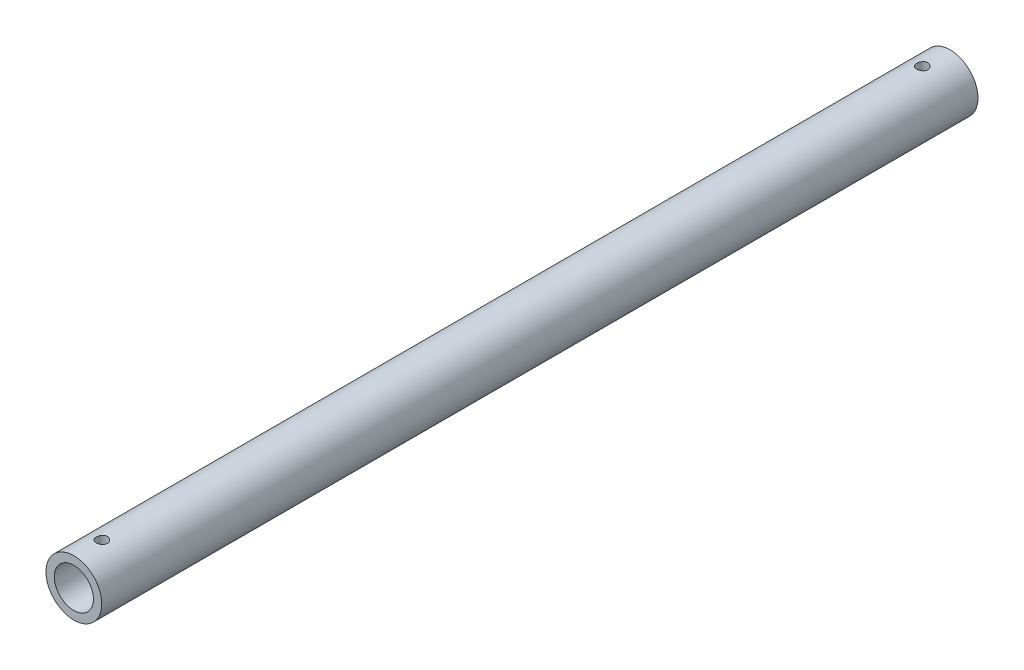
ISO-10303-21;
HEADER;
FILE_DESCRIPTION(('STEP AP214'),'2;1');
FILE_NAME('part.step','',(''),(''),'','','');
FILE_SCHEMA(('AUTOMOTIVE_DESIGN { 1 0 10303 214 1 1 1 1 }'));
ENDSEC;
DATA;
#1=APPLICATION_CONTEXT('core data for automotive mechanical design processes');
#2=APPLICATION_PROTOCOL_DEFINITION('international standard','automotive_design',2000,#1);
#3=PRODUCT_CONTEXT('',#1,'mechanical');
#4=PRODUCT('Part','Part','',(#3));
#5=PRODUCT_RELATED_PRODUCT_CATEGORY('part','',(#4));
#6=PRODUCT_DEFINITION_FORMATION('','',#4);
#7=PRODUCT_DEFINITION_CONTEXT('part definition',#1,'design');
#8=PRODUCT_DEFINITION('design','',#6,#7);
#9=PRODUCT_DEFINITION_SHAPE('','',#8);
#10=(LENGTH_UNIT() NAMED_UNIT(*) SI_UNIT(.MILLI.,.METRE.));
#11=(NAMED_UNIT(*) PLANE_ANGLE_UNIT() SI_UNIT($,.RADIAN.));
#12=(NAMED_UNIT(*) SI_UNIT($,.STERADIAN.) SOLID_ANGLE_UNIT());
#13=UNCERTAINTY_MEASURE_WITH_UNIT(LENGTH_MEASURE(1.E-05),#10,'distance_accuracy_value','');
#14=(GEOMETRIC_REPRESENTATION_CONTEXT(3) GLOBAL_UNCERTAINTY_ASSIGNED_CONTEXT((#13)) GLOBAL_UNIT_ASSIGNED_CONTEXT((#10,
#11,#12)) REPRESENTATION_CONTEXT('',''));
#15=CARTESIAN_POINT('',(0.,0.,0.));
#16=DIRECTION('',(0.,0.,1.));
#17=DIRECTION('',(1.,0.,0.));
#18=AXIS2_PLACEMENT_3D('',#15,#16,#17);
#19=CARTESIAN_POINT('',(0.,0.,157.));
#20=DIRECTION('',(0.,0.,-1.));
#21=DIRECTION('',(-1.,0.,0.));
#22=AXIS2_PLACEMENT_3D('',#19,#20,#21);
#23=CYLINDRICAL_SURFACE('',#22,5.);
#24=CARTESIAN_POINT('',(0.,0.,157.));
#25=DIRECTION('',(0.,0.,1.));
#26=DIRECTION('',(1.,0.,0.));
#27=AXIS2_PLACEMENT_3D('',#24,#25,#26);
#28=CIRCLE('',#27,5.);
#29=CARTESIAN_POINT('',(5.,0.,157.));
#30=VERTEX_POINT('',#29);
#31=EDGE_CURVE('E10',#30,#30,#28,.T.);
#32=ORIENTED_EDGE('',*,*,#31,.F.);
#33=EDGE_LOOP('',(#32));
#34=FACE_BOUND('',#33,.T.);
#35=CARTESIAN_POINT('',(0.,0.,0.));
#36=DIRECTION('',(0.,0.,1.));
#37=DIRECTION('',(1.,0.,0.));
#38=AXIS2_PLACEMENT_3D('',#35,#36,#37);
#39=CIRCLE('',#38,5.);
#40=CARTESIAN_POINT('',(5.,0.,0.));
#41=VERTEX_POINT('',#40);
#42=EDGE_CURVE('E49',#41,#41,#39,.T.);
#43=ORIENTED_EDGE('',*,*,#42,.T.);
#44=EDGE_LOOP('',(#43));
#45=FACE_BOUND('',#44,.T.);
#46=CARTESIAN_POINT('',(0.,-5.,151.));
#47=CARTESIAN_POINT('',(0.0555769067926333,-4.99999897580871,151.000002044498));
#48=CARTESIAN_POINT('',(0.111179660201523,-4.99906385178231,151.004648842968));
#49=CARTESIAN_POINT('',(0.220813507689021,-4.99542365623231,151.023098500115));
#50=CARTESIAN_POINT('',(0.274843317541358,-4.99271717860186,151.036908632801));
#51=CARTESIAN_POINT('',(0.379730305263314,-4.98583649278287,151.073241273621));
#52=CARTESIAN_POINT('',(0.430590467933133,-4.98166369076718,151.095755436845));
#53=CARTESIAN_POINT('',(0.527807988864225,-4.97230398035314,151.148832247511));
#54=CARTESIAN_POINT('',(0.574165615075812,-4.96711713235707,151.179394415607));
#55=CARTESIAN_POINT('',(0.661693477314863,-4.9562216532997,151.248138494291));
#56=CARTESIAN_POINT('',(0.70279395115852,-4.95050745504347,151.286408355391));
#57=CARTESIAN_POINT('',(0.778036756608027,-4.93924180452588,151.369292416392));
#58=CARTESIAN_POINT('',(0.812178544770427,-4.93369036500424,151.413907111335));
#59=CARTESIAN_POINT('',(0.872831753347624,-4.92332441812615,151.508716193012));
#60=CARTESIAN_POINT('',(0.89927093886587,-4.91851707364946,151.558957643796));
#61=CARTESIAN_POINT('',(0.943305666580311,-4.91026268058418,151.663281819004));
#62=CARTESIAN_POINT('',(0.960902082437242,-4.90681549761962,151.717364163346));
#63=CARTESIAN_POINT('',(0.986525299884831,-4.90172805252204,151.827084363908));
#64=CARTESIAN_POINT('',(0.994674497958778,-4.90006470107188,151.882692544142));
#65=CARTESIAN_POINT('',(1.00155212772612,-4.89866375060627,151.994509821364));
#66=CARTESIAN_POINT('',(1.0002815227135,-4.89892595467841,152.05071885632));
#67=CARTESIAN_POINT('',(0.988454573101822,-4.90132551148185,152.161246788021));
#68=CARTESIAN_POINT('',(0.978038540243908,-4.90343452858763,152.215581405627));
#69=CARTESIAN_POINT('',(0.948437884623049,-4.90924546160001,152.321716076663));
#70=CARTESIAN_POINT('',(0.929252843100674,-4.91294745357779,152.373516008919));
#71=CARTESIAN_POINT('',(0.882524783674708,-4.92155618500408,152.473515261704));
#72=CARTESIAN_POINT('',(0.854926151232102,-4.92647089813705,152.521687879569));
#73=CARTESIAN_POINT('',(0.792193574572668,-4.93694618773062,152.612770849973));
#74=CARTESIAN_POINT('',(0.757058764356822,-4.94250683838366,152.655680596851));
#75=CARTESIAN_POINT('',(0.679499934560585,-4.95377021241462,152.735829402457));
#76=CARTESIAN_POINT('',(0.636956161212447,-4.95947369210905,152.772952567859));
#77=CARTESIAN_POINT('',(0.546185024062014,-4.97028848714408,152.839553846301));
#78=CARTESIAN_POINT('',(0.497957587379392,-4.97539979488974,152.869031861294));
#79=CARTESIAN_POINT('',(0.397059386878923,-4.98446690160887,152.919527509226));
#80=CARTESIAN_POINT('',(0.344381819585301,-4.98842088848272,152.940531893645));
#81=CARTESIAN_POINT('',(0.236148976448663,-4.99471408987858,152.973360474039));
#82=CARTESIAN_POINT('',(0.180594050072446,-4.99705350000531,152.985185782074));
#83=CARTESIAN_POINT('',(0.0691794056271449,-4.99982671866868,152.999156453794));
#84=CARTESIAN_POINT('',(0.0133403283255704,-5.0002917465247,153.00146041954));
#85=CARTESIAN_POINT('',(-0.0979249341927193,-4.99935051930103,152.996750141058));
#86=CARTESIAN_POINT('',(-0.153351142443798,-4.99794436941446,152.989736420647));
#87=CARTESIAN_POINT('',(-0.261705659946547,-4.99343832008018,152.966721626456));
#88=CARTESIAN_POINT('',(-0.314651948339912,-4.99035376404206,152.950801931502));
#89=CARTESIAN_POINT('',(-0.417123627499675,-4.98283552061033,152.910516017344));
#90=CARTESIAN_POINT('',(-0.466648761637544,-4.97840173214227,152.886149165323));
#91=CARTESIAN_POINT('',(-0.561541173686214,-4.96859911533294,152.829317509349));
#92=CARTESIAN_POINT('',(-0.60685012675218,-4.96321950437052,152.796757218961));
#93=CARTESIAN_POINT('',(-0.691418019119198,-4.95214734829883,152.724590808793));
#94=CARTESIAN_POINT('',(-0.730676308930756,-4.94645476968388,152.6849839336));
#95=CARTESIAN_POINT('',(-0.802640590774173,-4.93529303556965,152.599126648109));
#96=CARTESIAN_POINT('',(-0.835237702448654,-4.92982860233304,152.552784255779));
#97=CARTESIAN_POINT('',(-0.892185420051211,-4.91984191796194,152.455188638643));
#98=CARTESIAN_POINT('',(-0.916536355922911,-4.91531962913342,152.403935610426));
#99=CARTESIAN_POINT('',(-0.956151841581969,-4.90776740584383,152.29823175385));
#100=CARTESIAN_POINT('',(-0.971463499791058,-4.90472974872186,152.24379915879));
#101=CARTESIAN_POINT('',(-0.9927086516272,-4.90047436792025,152.133066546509));
#102=CARTESIAN_POINT('',(-0.998643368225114,-4.89925640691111,152.076766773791));
#103=CARTESIAN_POINT('',(-1.00092091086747,-4.89879149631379,151.964991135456));
#104=CARTESIAN_POINT('',(-0.997435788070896,-4.89950919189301,151.909518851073));
#105=CARTESIAN_POINT('',(-0.981352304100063,-4.90275573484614,151.799968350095));
#106=CARTESIAN_POINT('',(-0.968754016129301,-4.90528456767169,151.745890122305));
#107=CARTESIAN_POINT('',(-0.93487856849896,-4.91185264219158,151.640772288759));
#108=CARTESIAN_POINT('',(-0.913622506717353,-4.9158882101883,151.589725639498));
#109=CARTESIAN_POINT('',(-0.863054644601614,-4.9250171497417,151.491896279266));
#110=CARTESIAN_POINT('',(-0.83374216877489,-4.93011060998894,151.445113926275));
#111=CARTESIAN_POINT('',(-0.767305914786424,-4.94088960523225,151.35628442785));
#112=CARTESIAN_POINT('',(-0.730057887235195,-4.94658372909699,151.314331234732));
#113=CARTESIAN_POINT('',(-0.649064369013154,-4.95786081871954,151.237213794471));
#114=CARTESIAN_POINT('',(-0.605317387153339,-4.96344375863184,151.202051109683));
#115=CARTESIAN_POINT('',(-0.512017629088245,-4.97393832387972,151.139165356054));
#116=CARTESIAN_POINT('',(-0.462408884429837,-4.97884231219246,151.11152399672));
#117=CARTESIAN_POINT('',(-0.359166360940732,-4.98735125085,151.065013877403));
#118=CARTESIAN_POINT('',(-0.30553626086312,-4.99095737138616,151.046137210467));
#119=CARTESIAN_POINT('',(-0.209821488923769,-4.99576372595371,151.021348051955));
#120=CARTESIAN_POINT('',(-0.168281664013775,-4.99734303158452,151.013356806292));
#121=CARTESIAN_POINT('',(-0.0844995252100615,-4.99946154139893,151.002682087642));
#122=CARTESIAN_POINT('',(-0.0422572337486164,-5.00000077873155,150.99999844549));
#123=CARTESIAN_POINT('',(0.,-5.,151.));
#124=B_SPLINE_CURVE_WITH_KNOTS('',3,(#46,#47,#48,#49,#50,#51,#52,#53,#54,#55,#56,#57,#58,#59,
#60,#61,#62,#63,#64,#65,#66,#67,#68,#69,#70,#71,#72,#73,#74,#75,#76,#77,#78,#79,#80,#81,#82,#83,
#84,#85,#86,#87,#88,#89,#90,#91,#92,#93,#94,#95,#96,#97,#98,#99,#100,#101,#102,#103,#104,#105,
#106,#107,#108,#109,#110,#111,#112,#113,#114,#115,#116,#117,#118,#119,#120,#121,#122,#123),
.UNSPECIFIED.,.T.,.F.,(4,2,2,2,2,2,2,2,2,2,2,2,2,2,2,2,2,2,2,2,2,2,2,2,2,2,2,2,2,2,2,2,2,2,2,2,
2,2,4),(0.,0.166576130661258,0.333284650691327,0.499833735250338,0.666372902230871,
0.834932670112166,1.00350559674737,1.17361195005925,1.34370149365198,1.51156185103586,
1.67940504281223,1.84471727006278,2.01003739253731,2.17647490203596,2.34293154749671,
2.51238252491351,2.6818356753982,2.85155274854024,3.02124925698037,3.18810735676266,
3.35495607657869,3.52030453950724,3.68566539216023,3.85305066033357,4.0204538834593,
4.19040628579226,4.3603518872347,4.52940381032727,4.69843368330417,4.86439722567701,
5.03035943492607,5.19591961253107,5.36149367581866,5.5298807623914,5.6983065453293,
5.86849496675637,6.0385295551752,6.16518775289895,6.29184191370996),.UNSPECIFIED.);
#125=CARTESIAN_POINT('',(0.,-5.,151.));
#126=VERTEX_POINT('',#125);
#127=EDGE_CURVE('E88',#126,#126,#124,.T.);
#128=ORIENTED_EDGE('',*,*,#127,.F.);
#129=EDGE_LOOP('',(#128));
#130=FACE_BOUND('',#129,.T.);
#131=CARTESIAN_POINT('',(0.,5.,151.));
#132=CARTESIAN_POINT('',(-0.0555769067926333,4.99999897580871,151.000002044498));
#133=CARTESIAN_POINT('',(-0.111179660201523,4.99906385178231,151.004648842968));
#134=CARTESIAN_POINT('',(-0.220813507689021,4.99542365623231,151.023098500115));
#135=CARTESIAN_POINT('',(-0.274843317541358,4.99271717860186,151.036908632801));
#136=CARTESIAN_POINT('',(-0.379730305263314,4.98583649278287,151.073241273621));
#137=CARTESIAN_POINT('',(-0.430590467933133,4.98166369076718,151.095755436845));
#138=CARTESIAN_POINT('',(-0.527807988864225,4.97230398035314,151.148832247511));
#139=CARTESIAN_POINT('',(-0.574165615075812,4.96711713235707,151.179394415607));
#140=CARTESIAN_POINT('',(-0.661693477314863,4.9562216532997,151.248138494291));
#141=CARTESIAN_POINT('',(-0.70279395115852,4.95050745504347,151.286408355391));
#142=CARTESIAN_POINT('',(-0.778036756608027,4.93924180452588,151.369292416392));
#143=CARTESIAN_POINT('',(-0.812178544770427,4.93369036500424,151.413907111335));
#144=CARTESIAN_POINT('',(-0.872831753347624,4.92332441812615,151.508716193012));
#145=CARTESIAN_POINT('',(-0.89927093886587,4.91851707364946,151.558957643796));
#146=CARTESIAN_POINT('',(-0.943305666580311,4.91026268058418,151.663281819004));
#147=CARTESIAN_POINT('',(-0.960902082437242,4.90681549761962,151.717364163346));
#148=CARTESIAN_POINT('',(-0.986525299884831,4.90172805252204,151.827084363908));
#149=CARTESIAN_POINT('',(-0.994674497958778,4.90006470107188,151.882692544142));
#150=CARTESIAN_POINT('',(-1.00155212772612,4.89866375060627,151.994509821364));
#151=CARTESIAN_POINT('',(-1.0002815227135,4.89892595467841,152.05071885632));
#152=CARTESIAN_POINT('',(-0.988454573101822,4.90132551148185,152.161246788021));
#153=CARTESIAN_POINT('',(-0.978038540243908,4.90343452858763,152.215581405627));
#154=CARTESIAN_POINT('',(-0.948437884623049,4.90924546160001,152.321716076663));
#155=CARTESIAN_POINT('',(-0.929252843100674,4.91294745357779,152.373516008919));
#156=CARTESIAN_POINT('',(-0.882524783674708,4.92155618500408,152.473515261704));
#157=CARTESIAN_POINT('',(-0.854926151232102,4.92647089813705,152.521687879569));
#158=CARTESIAN_POINT('',(-0.792193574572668,4.93694618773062,152.612770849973));
#159=CARTESIAN_POINT('',(-0.757058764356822,4.94250683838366,152.655680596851));
#160=CARTESIAN_POINT('',(-0.679499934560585,4.95377021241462,152.735829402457));
#161=CARTESIAN_POINT('',(-0.636956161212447,4.95947369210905,152.772952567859));
#162=CARTESIAN_POINT('',(-0.546185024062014,4.97028848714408,152.839553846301));
#163=CARTESIAN_POINT('',(-0.497957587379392,4.97539979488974,152.869031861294));
#164=CARTESIAN_POINT('',(-0.397059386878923,4.98446690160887,152.919527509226));
#165=CARTESIAN_POINT('',(-0.344381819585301,4.98842088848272,152.940531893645));
#166=CARTESIAN_POINT('',(-0.236148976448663,4.99471408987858,152.973360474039));
#167=CARTESIAN_POINT('',(-0.180594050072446,4.99705350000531,152.985185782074));
#168=CARTESIAN_POINT('',(-0.0691794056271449,4.99982671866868,152.999156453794));
#169=CARTESIAN_POINT('',(-0.0133403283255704,5.0002917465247,153.00146041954));
#170=CARTESIAN_POINT('',(0.0979249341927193,4.99935051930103,152.996750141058));
#171=CARTESIAN_POINT('',(0.153351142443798,4.99794436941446,152.989736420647));
#172=CARTESIAN_POINT('',(0.261705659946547,4.99343832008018,152.966721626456));
#173=CARTESIAN_POINT('',(0.314651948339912,4.99035376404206,152.950801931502));
#174=CARTESIAN_POINT('',(0.417123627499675,4.98283552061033,152.910516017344));
#175=CARTESIAN_POINT('',(0.466648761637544,4.97840173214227,152.886149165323));
#176=CARTESIAN_POINT('',(0.561541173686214,4.96859911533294,152.829317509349));
#177=CARTESIAN_POINT('',(0.60685012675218,4.96321950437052,152.796757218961));
#178=CARTESIAN_POINT('',(0.691418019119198,4.95214734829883,152.724590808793));
#179=CARTESIAN_POINT('',(0.730676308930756,4.94645476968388,152.6849839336));
#180=CARTESIAN_POINT('',(0.802640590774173,4.93529303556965,152.599126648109));
#181=CARTESIAN_POINT('',(0.835237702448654,4.92982860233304,152.552784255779));
#182=CARTESIAN_POINT('',(0.892185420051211,4.91984191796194,152.455188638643));
#183=CARTESIAN_POINT('',(0.916536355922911,4.91531962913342,152.403935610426));
#184=CARTESIAN_POINT('',(0.956151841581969,4.90776740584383,152.29823175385));
#185=CARTESIAN_POINT('',(0.971463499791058,4.90472974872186,152.24379915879));
#186=CARTESIAN_POINT('',(0.9927086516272,4.90047436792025,152.133066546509));
#187=CARTESIAN_POINT('',(0.998643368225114,4.89925640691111,152.076766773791));
#188=CARTESIAN_POINT('',(1.00092091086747,4.89879149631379,151.964991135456));
#189=CARTESIAN_POINT('',(0.997435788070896,4.89950919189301,151.909518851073));
#190=CARTESIAN_POINT('',(0.981352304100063,4.90275573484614,151.799968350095));
#191=CARTESIAN_POINT('',(0.968754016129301,4.90528456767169,151.745890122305));
#192=CARTESIAN_POINT('',(0.93487856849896,4.91185264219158,151.640772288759));
#193=CARTESIAN_POINT('',(0.913622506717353,4.9158882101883,151.589725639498));
#194=CARTESIAN_POINT('',(0.863054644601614,4.9250171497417,151.491896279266));
#195=CARTESIAN_POINT('',(0.83374216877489,4.93011060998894,151.445113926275));
#196=CARTESIAN_POINT('',(0.767305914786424,4.94088960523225,151.35628442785));
#197=CARTESIAN_POINT('',(0.730057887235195,4.94658372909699,151.314331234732));
#198=CARTESIAN_POINT('',(0.649064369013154,4.95786081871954,151.237213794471));
#199=CARTESIAN_POINT('',(0.605317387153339,4.96344375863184,151.202051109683));
#200=CARTESIAN_POINT('',(0.512017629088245,4.97393832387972,151.139165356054));
#201=CARTESIAN_POINT('',(0.462408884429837,4.97884231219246,151.11152399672));
#202=CARTESIAN_POINT('',(0.359166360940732,4.98735125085,151.065013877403));
#203=CARTESIAN_POINT('',(0.30553626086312,4.99095737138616,151.046137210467));
#204=CARTESIAN_POINT('',(0.209821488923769,4.99576372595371,151.021348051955));
#205=CARTESIAN_POINT('',(0.168281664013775,4.99734303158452,151.013356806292));
#206=CARTESIAN_POINT('',(0.0844995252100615,4.99946154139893,151.002682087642));
#207=CARTESIAN_POINT('',(0.0422572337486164,5.00000077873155,150.99999844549));
#208=CARTESIAN_POINT('',(0.,5.,151.));
#209=B_SPLINE_CURVE_WITH_KNOTS('',3,(#131,#132,#133,#134,#135,#136,#137,#138,#139,#140,#141,
#142,#143,#144,#145,#146,#147,#148,#149,#150,#151,#152,#153,#154,#155,#156,#157,#158,#159,#160,
#161,#162,#163,#164,#165,#166,#167,#168,#169,#170,#171,#172,#173,#174,#175,#176,#177,#178,#179,
#180,#181,#182,#183,#184,#185,#186,#187,#188,#189,#190,#191,#192,#193,#194,#195,#196,#197,#198,
#199,#200,#201,#202,#203,#204,#205,#206,#207,#208),.UNSPECIFIED.,.T.,.F.,(4,2,2,2,2,2,2,2,2,2,2,
2,2,2,2,2,2,2,2,2,2,2,2,2,2,2,2,2,2,2,2,2,2,2,2,2,2,2,4),(0.,0.166576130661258,
0.333284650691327,0.499833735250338,0.666372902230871,0.834932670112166,1.00350559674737,
1.17361195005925,1.34370149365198,1.51156185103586,1.67940504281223,1.84471727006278,
2.01003739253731,2.17647490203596,2.34293154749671,2.51238252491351,2.6818356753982,
2.85155274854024,3.02124925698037,3.18810735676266,3.35495607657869,3.52030453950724,
3.68566539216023,3.85305066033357,4.0204538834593,4.19040628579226,4.3603518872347,
4.52940381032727,4.69843368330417,4.86439722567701,5.03035943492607,5.19591961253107,
5.36149367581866,5.5298807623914,5.6983065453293,5.86849496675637,6.0385295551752,
6.16518775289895,6.29184191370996),.UNSPECIFIED.);
#210=CARTESIAN_POINT('',(0.,5.,151.));
#211=VERTEX_POINT('',#210);
#212=EDGE_CURVE('E94',#211,#211,#209,.T.);
#213=ORIENTED_EDGE('',*,*,#212,.F.);
#214=EDGE_LOOP('',(#213));
#215=FACE_BOUND('',#214,.T.);
#216=CARTESIAN_POINT('',(0.,-5.,4.));
#217=CARTESIAN_POINT('',(0.0555769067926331,-4.99999897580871,4.00000204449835));
#218=CARTESIAN_POINT('',(0.111179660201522,-4.99906385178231,4.00464884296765));
#219=CARTESIAN_POINT('',(0.220813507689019,-4.99542365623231,4.02309850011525));
#220=CARTESIAN_POINT('',(0.274843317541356,-4.99271717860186,4.03690863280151));
#221=CARTESIAN_POINT('',(0.379730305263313,-4.98583649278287,4.07324127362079));
#222=CARTESIAN_POINT('',(0.430590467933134,-4.98166369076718,4.09575543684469));
#223=CARTESIAN_POINT('',(0.527807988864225,-4.97230398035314,4.1488322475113));
#224=CARTESIAN_POINT('',(0.574165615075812,-4.96711713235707,4.17939441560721));
#225=CARTESIAN_POINT('',(0.661693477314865,-4.9562216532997,4.24813849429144));
#226=CARTESIAN_POINT('',(0.702793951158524,-4.95050745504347,4.28640835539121));
#227=CARTESIAN_POINT('',(0.778036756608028,-4.93924180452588,4.36929241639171));
#228=CARTESIAN_POINT('',(0.812178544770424,-4.93369036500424,4.41390711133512));
#229=CARTESIAN_POINT('',(0.87283175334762,-4.92332441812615,4.50871619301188));
#230=CARTESIAN_POINT('',(0.899270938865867,-4.91851707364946,4.55895764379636));
#231=CARTESIAN_POINT('',(0.943305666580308,-4.91026268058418,4.66328181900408));
#232=CARTESIAN_POINT('',(0.960902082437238,-4.90681549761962,4.71736416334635));
#233=CARTESIAN_POINT('',(0.986525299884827,-4.90172805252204,4.82708436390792));
#234=CARTESIAN_POINT('',(0.994674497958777,-4.90006470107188,4.88269254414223));
#235=CARTESIAN_POINT('',(1.00155212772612,-4.89866375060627,4.99450982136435));
#236=CARTESIAN_POINT('',(1.0002815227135,-4.89892595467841,5.05071885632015));
#237=CARTESIAN_POINT('',(0.988454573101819,-4.90132551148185,5.16124678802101));
#238=CARTESIAN_POINT('',(0.978038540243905,-4.90343452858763,5.21558140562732));
#239=CARTESIAN_POINT('',(0.948437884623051,-4.90924546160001,5.32171607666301));
#240=CARTESIAN_POINT('',(0.929252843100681,-4.91294745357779,5.37351600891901));
#241=CARTESIAN_POINT('',(0.88252478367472,-4.92155618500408,5.4735152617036));
#242=CARTESIAN_POINT('',(0.854926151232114,-4.92647089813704,5.52168787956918));
#243=CARTESIAN_POINT('',(0.792193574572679,-4.93694618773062,5.61277084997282));
#244=CARTESIAN_POINT('',(0.757058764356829,-4.94250683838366,5.65568059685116));
#245=CARTESIAN_POINT('',(0.679499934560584,-4.95377021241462,5.73582940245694));
#246=CARTESIAN_POINT('',(0.636956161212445,-4.95947369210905,5.77295256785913));
#247=CARTESIAN_POINT('',(0.54618502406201,-4.97028848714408,5.83955384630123));
#248=CARTESIAN_POINT('',(0.497957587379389,-4.97539979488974,5.86903186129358));
#249=CARTESIAN_POINT('',(0.397059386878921,-4.98446690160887,5.91952750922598));
#250=CARTESIAN_POINT('',(0.344381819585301,-4.98842088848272,5.94053189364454));
#251=CARTESIAN_POINT('',(0.236148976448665,-4.99471408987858,5.97336047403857));
#252=CARTESIAN_POINT('',(0.18059405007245,-4.99705350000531,5.98518578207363));
#253=CARTESIAN_POINT('',(0.0691794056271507,-4.99982671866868,5.99915645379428));
#254=CARTESIAN_POINT('',(0.0133403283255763,-5.0002917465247,6.00146041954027));
#255=CARTESIAN_POINT('',(-0.0979249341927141,-4.99935051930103,5.99675014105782));
#256=CARTESIAN_POINT('',(-0.153351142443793,-4.99794436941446,5.98973642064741));
#257=CARTESIAN_POINT('',(-0.261705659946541,-4.99343832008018,5.96672162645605));
#258=CARTESIAN_POINT('',(-0.314651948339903,-4.99035376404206,5.9508019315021));
#259=CARTESIAN_POINT('',(-0.417123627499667,-4.98283552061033,5.9105160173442));
#260=CARTESIAN_POINT('',(-0.46664876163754,-4.97840173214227,5.88614916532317));
#261=CARTESIAN_POINT('',(-0.561541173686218,-4.96859911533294,5.82931750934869));
#262=CARTESIAN_POINT('',(-0.606850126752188,-4.96321950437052,5.79675721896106));
#263=CARTESIAN_POINT('',(-0.691418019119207,-4.95214734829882,5.72459080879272));
#264=CARTESIAN_POINT('',(-0.730676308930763,-4.94645476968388,5.68498393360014));
#265=CARTESIAN_POINT('',(-0.802640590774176,-4.93529303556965,5.59912664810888));
#266=CARTESIAN_POINT('',(-0.835237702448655,-4.92982860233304,5.55278425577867));
#267=CARTESIAN_POINT('',(-0.892185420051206,-4.91984191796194,5.45518863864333));
#268=CARTESIAN_POINT('',(-0.916536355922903,-4.91531962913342,5.40393561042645));
#269=CARTESIAN_POINT('',(-0.956151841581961,-4.90776740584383,5.29823175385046));
#270=CARTESIAN_POINT('',(-0.971463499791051,-4.90472974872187,5.24379915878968));
#271=CARTESIAN_POINT('',(-0.992708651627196,-4.90047436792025,5.1330665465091));
#272=CARTESIAN_POINT('',(-0.998643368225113,-4.89925640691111,5.07676677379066));
#273=CARTESIAN_POINT('',(-1.00092091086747,-4.89879149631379,4.96499113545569));
#274=CARTESIAN_POINT('',(-0.997435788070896,-4.89950919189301,4.90951885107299));
#275=CARTESIAN_POINT('',(-0.981352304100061,-4.90275573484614,4.79996835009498));
#276=CARTESIAN_POINT('',(-0.968754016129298,-4.90528456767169,4.7458901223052));
#277=CARTESIAN_POINT('',(-0.934878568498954,-4.91185264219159,4.64077228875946));
#278=CARTESIAN_POINT('',(-0.913622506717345,-4.91588821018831,4.58972563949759));
#279=CARTESIAN_POINT('',(-0.863054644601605,-4.9250171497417,4.49189627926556));
#280=CARTESIAN_POINT('',(-0.833742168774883,-4.93011060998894,4.44511392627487));
#281=CARTESIAN_POINT('',(-0.767305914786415,-4.94088960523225,4.35628442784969));
#282=CARTESIAN_POINT('',(-0.730057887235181,-4.94658372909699,4.31433123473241));
#283=CARTESIAN_POINT('',(-0.649064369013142,-4.95786081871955,4.23721379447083));
#284=CARTESIAN_POINT('',(-0.605317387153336,-4.96344375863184,4.20205110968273));
#285=CARTESIAN_POINT('',(-0.512017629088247,-4.97393832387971,4.13916535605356));
#286=CARTESIAN_POINT('',(-0.462408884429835,-4.97884231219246,4.11152399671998));
#287=CARTESIAN_POINT('',(-0.359166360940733,-4.98735125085,4.06501387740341));
#288=CARTESIAN_POINT('',(-0.305536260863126,-4.99095737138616,4.04613721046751));
#289=CARTESIAN_POINT('',(-0.209821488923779,-4.99576372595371,4.02134805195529));
#290=CARTESIAN_POINT('',(-0.168281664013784,-4.99734303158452,4.01335680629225));
#291=CARTESIAN_POINT('',(-0.0844995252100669,-4.99946154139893,4.00268208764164));
#292=CARTESIAN_POINT('',(-0.042257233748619,-5.00000077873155,3.99999844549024));
#293=CARTESIAN_POINT('',(0.,-5.,4.));
#294=B_SPLINE_CURVE_WITH_KNOTS('',3,(#216,#217,#218,#219,#220,#221,#222,#223,#224,#225,#226,
#227,#228,#229,#230,#231,#232,#233,#234,#235,#236,#237,#238,#239,#240,#241,#242,#243,#244,#245,
#246,#247,#248,#249,#250,#251,#252,#253,#254,#255,#256,#257,#258,#259,#260,#261,#262,#263,#264,
#265,#266,#267,#268,#269,#270,#271,#272,#273,#274,#275,#276,#277,#278,#279,#280,#281,#282,#283,
#284,#285,#286,#287,#288,#289,#290,#291,#292,#293),.UNSPECIFIED.,.T.,.F.,(4,2,2,2,2,2,2,2,2,2,2,
2,2,2,2,2,2,2,2,2,2,2,2,2,2,2,2,2,2,2,2,2,2,2,2,2,2,2,4),(0.,0.166576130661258,
0.333284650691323,0.499833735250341,0.666372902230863,0.834932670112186,1.00350559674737,
1.17361195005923,1.34370149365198,1.51156185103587,1.67940504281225,1.84471727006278,
2.0100373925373,2.17647490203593,2.34293154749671,2.51238252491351,2.6818356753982,
2.85155274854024,3.02124925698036,3.18810735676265,3.35495607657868,3.52030453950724,
3.68566539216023,3.85305066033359,4.0204538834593,4.19040628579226,4.36035188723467,
4.52940381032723,4.69843368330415,4.86439722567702,5.03035943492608,5.1959196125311,
5.36149367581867,5.52988076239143,5.69830654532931,5.86849496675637,6.03852955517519,
6.16518775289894,6.29184191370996),.UNSPECIFIED.);
#295=CARTESIAN_POINT('',(0.,-5.,4.));
#296=VERTEX_POINT('',#295);
#297=EDGE_CURVE('E121',#296,#296,#294,.T.);
#298=ORIENTED_EDGE('',*,*,#297,.F.);
#299=EDGE_LOOP('',(#298));
#300=FACE_BOUND('',#299,.T.);
#301=CARTESIAN_POINT('',(0.,5.,4.));
#302=CARTESIAN_POINT('',(-0.0555769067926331,4.99999897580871,4.00000204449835));
#303=CARTESIAN_POINT('',(-0.111179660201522,4.99906385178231,4.00464884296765));
#304=CARTESIAN_POINT('',(-0.220813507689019,4.99542365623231,4.02309850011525));
#305=CARTESIAN_POINT('',(-0.274843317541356,4.99271717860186,4.03690863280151));
#306=CARTESIAN_POINT('',(-0.379730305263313,4.98583649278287,4.07324127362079));
#307=CARTESIAN_POINT('',(-0.430590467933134,4.98166369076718,4.09575543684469));
#308=CARTESIAN_POINT('',(-0.527807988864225,4.97230398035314,4.1488322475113));
#309=CARTESIAN_POINT('',(-0.574165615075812,4.96711713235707,4.17939441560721));
#310=CARTESIAN_POINT('',(-0.661693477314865,4.9562216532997,4.24813849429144));
#311=CARTESIAN_POINT('',(-0.702793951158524,4.95050745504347,4.28640835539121));
#312=CARTESIAN_POINT('',(-0.778036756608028,4.93924180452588,4.36929241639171));
#313=CARTESIAN_POINT('',(-0.812178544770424,4.93369036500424,4.41390711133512));
#314=CARTESIAN_POINT('',(-0.87283175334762,4.92332441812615,4.50871619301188));
#315=CARTESIAN_POINT('',(-0.899270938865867,4.91851707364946,4.55895764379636));
#316=CARTESIAN_POINT('',(-0.943305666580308,4.91026268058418,4.66328181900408));
#317=CARTESIAN_POINT('',(-0.960902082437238,4.90681549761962,4.71736416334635));
#318=CARTESIAN_POINT('',(-0.986525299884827,4.90172805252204,4.82708436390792));
#319=CARTESIAN_POINT('',(-0.994674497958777,4.90006470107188,4.88269254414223));
#320=CARTESIAN_POINT('',(-1.00155212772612,4.89866375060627,4.99450982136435));
#321=CARTESIAN_POINT('',(-1.0002815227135,4.89892595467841,5.05071885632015));
#322=CARTESIAN_POINT('',(-0.988454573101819,4.90132551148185,5.16124678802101));
#323=CARTESIAN_POINT('',(-0.978038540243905,4.90343452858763,5.21558140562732));
#324=CARTESIAN_POINT('',(-0.948437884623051,4.90924546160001,5.32171607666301));
#325=CARTESIAN_POINT('',(-0.929252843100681,4.91294745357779,5.37351600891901));
#326=CARTESIAN_POINT('',(-0.88252478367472,4.92155618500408,5.4735152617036));
#327=CARTESIAN_POINT('',(-0.854926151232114,4.92647089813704,5.52168787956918));
#328=CARTESIAN_POINT('',(-0.792193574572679,4.93694618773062,5.61277084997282));
#329=CARTESIAN_POINT('',(-0.757058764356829,4.94250683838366,5.65568059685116));
#330=CARTESIAN_POINT('',(-0.679499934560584,4.95377021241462,5.73582940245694));
#331=CARTESIAN_POINT('',(-0.636956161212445,4.95947369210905,5.77295256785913));
#332=CARTESIAN_POINT('',(-0.54618502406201,4.97028848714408,5.83955384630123));
#333=CARTESIAN_POINT('',(-0.497957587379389,4.97539979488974,5.86903186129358));
#334=CARTESIAN_POINT('',(-0.397059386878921,4.98446690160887,5.91952750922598));
#335=CARTESIAN_POINT('',(-0.344381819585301,4.98842088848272,5.94053189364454));
#336=CARTESIAN_POINT('',(-0.236148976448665,4.99471408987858,5.97336047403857));
#337=CARTESIAN_POINT('',(-0.18059405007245,4.99705350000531,5.98518578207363));
#338=CARTESIAN_POINT('',(-0.0691794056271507,4.99982671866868,5.99915645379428));
#339=CARTESIAN_POINT('',(-0.0133403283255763,5.0002917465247,6.00146041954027));
#340=CARTESIAN_POINT('',(0.0979249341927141,4.99935051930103,5.99675014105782));
#341=CARTESIAN_POINT('',(0.153351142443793,4.99794436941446,5.98973642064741));
#342=CARTESIAN_POINT('',(0.261705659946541,4.99343832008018,5.96672162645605));
#343=CARTESIAN_POINT('',(0.314651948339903,4.99035376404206,5.9508019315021));
#344=CARTESIAN_POINT('',(0.417123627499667,4.98283552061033,5.9105160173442));
#345=CARTESIAN_POINT('',(0.46664876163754,4.97840173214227,5.88614916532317));
#346=CARTESIAN_POINT('',(0.561541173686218,4.96859911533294,5.82931750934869));
#347=CARTESIAN_POINT('',(0.606850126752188,4.96321950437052,5.79675721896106));
#348=CARTESIAN_POINT('',(0.691418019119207,4.95214734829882,5.72459080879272));
#349=CARTESIAN_POINT('',(0.730676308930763,4.94645476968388,5.68498393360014));
#350=CARTESIAN_POINT('',(0.802640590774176,4.93529303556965,5.59912664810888));
#351=CARTESIAN_POINT('',(0.835237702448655,4.92982860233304,5.55278425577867));
#352=CARTESIAN_POINT('',(0.892185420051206,4.91984191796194,5.45518863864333));
#353=CARTESIAN_POINT('',(0.916536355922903,4.91531962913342,5.40393561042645));
#354=CARTESIAN_POINT('',(0.956151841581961,4.90776740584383,5.29823175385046));
#355=CARTESIAN_POINT('',(0.971463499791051,4.90472974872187,5.24379915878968));
#356=CARTESIAN_POINT('',(0.992708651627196,4.90047436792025,5.1330665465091));
#357=CARTESIAN_POINT('',(0.998643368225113,4.89925640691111,5.07676677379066));
#358=CARTESIAN_POINT('',(1.00092091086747,4.89879149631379,4.96499113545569));
#359=CARTESIAN_POINT('',(0.997435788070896,4.89950919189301,4.90951885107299));
#360=CARTESIAN_POINT('',(0.981352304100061,4.90275573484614,4.79996835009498));
#361=CARTESIAN_POINT('',(0.968754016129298,4.90528456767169,4.7458901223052));
#362=CARTESIAN_POINT('',(0.934878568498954,4.91185264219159,4.64077228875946));
#363=CARTESIAN_POINT('',(0.913622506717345,4.91588821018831,4.58972563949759));
#364=CARTESIAN_POINT('',(0.863054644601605,4.9250171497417,4.49189627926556));
#365=CARTESIAN_POINT('',(0.833742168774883,4.93011060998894,4.44511392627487));
#366=CARTESIAN_POINT('',(0.767305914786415,4.94088960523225,4.35628442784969));
#367=CARTESIAN_POINT('',(0.730057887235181,4.94658372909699,4.31433123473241));
#368=CARTESIAN_POINT('',(0.649064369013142,4.95786081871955,4.23721379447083));
#369=CARTESIAN_POINT('',(0.605317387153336,4.96344375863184,4.20205110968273));
#370=CARTESIAN_POINT('',(0.512017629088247,4.97393832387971,4.13916535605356));
#371=CARTESIAN_POINT('',(0.462408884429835,4.97884231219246,4.11152399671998));
#372=CARTESIAN_POINT('',(0.359166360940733,4.98735125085,4.06501387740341));
#373=CARTESIAN_POINT('',(0.305536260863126,4.99095737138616,4.04613721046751));
#374=CARTESIAN_POINT('',(0.209821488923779,4.99576372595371,4.02134805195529));
#375=CARTESIAN_POINT('',(0.168281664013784,4.99734303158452,4.01335680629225));
#376=CARTESIAN_POINT('',(0.0844995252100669,4.99946154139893,4.00268208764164));
#377=CARTESIAN_POINT('',(0.042257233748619,5.00000077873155,3.99999844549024));
#378=CARTESIAN_POINT('',(0.,5.,4.));
#379=B_SPLINE_CURVE_WITH_KNOTS('',3,(#301,#302,#303,#304,#305,#306,#307,#308,#309,#310,#311,
#312,#313,#314,#315,#316,#317,#318,#319,#320,#321,#322,#323,#324,#325,#326,#327,#328,#329,#330,
#331,#332,#333,#334,#335,#336,#337,#338,#339,#340,#341,#342,#343,#344,#345,#346,#347,#348,#349,
#350,#351,#352,#353,#354,#355,#356,#357,#358,#359,#360,#361,#362,#363,#364,#365,#366,#367,#368,
#369,#370,#371,#372,#373,#374,#375,#376,#377,#378),.UNSPECIFIED.,.T.,.F.,(4,2,2,2,2,2,2,2,2,2,2,
2,2,2,2,2,2,2,2,2,2,2,2,2,2,2,2,2,2,2,2,2,2,2,2,2,2,2,4),(0.,0.166576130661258,
0.333284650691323,0.499833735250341,0.666372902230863,0.834932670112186,1.00350559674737,
1.17361195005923,1.34370149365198,1.51156185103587,1.67940504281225,1.84471727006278,
2.0100373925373,2.17647490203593,2.34293154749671,2.51238252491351,2.6818356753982,
2.85155274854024,3.02124925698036,3.18810735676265,3.35495607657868,3.52030453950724,
3.68566539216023,3.85305066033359,4.0204538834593,4.19040628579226,4.36035188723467,
4.52940381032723,4.69843368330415,4.86439722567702,5.03035943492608,5.1959196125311,
5.36149367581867,5.52988076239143,5.69830654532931,5.86849496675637,6.03852955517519,
6.16518775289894,6.29184191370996),.UNSPECIFIED.);
#380=CARTESIAN_POINT('',(0.,5.,4.));
#381=VERTEX_POINT('',#380);
#382=EDGE_CURVE('E68',#381,#381,#379,.T.);
#383=ORIENTED_EDGE('',*,*,#382,.F.);
#384=EDGE_LOOP('',(#383));
#385=FACE_BOUND('',#384,.T.);
#386=ADVANCED_FACE('F36',(#34,#45,#130,#215,#300,#385),#23,.T.);
#387=CARTESIAN_POINT('',(0.,0.,157.));
#388=DIRECTION('',(0.,0.,-1.));
#389=DIRECTION('',(-1.,0.,0.));
#390=AXIS2_PLACEMENT_3D('',#387,#388,#389);
#391=CYLINDRICAL_SURFACE('',#390,3.505);
#392=CARTESIAN_POINT('',(0.,-3.505,4.));
#393=CARTESIAN_POINT('',(0.0549807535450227,-3.50499934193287,4.00000097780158));
#394=CARTESIAN_POINT('',(0.109971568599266,-3.50369379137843,4.00454944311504));
#395=CARTESIAN_POINT('',(0.218359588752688,-3.49861287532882,4.02258496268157));
#396=CARTESIAN_POINT('',(0.271756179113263,-3.49483656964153,4.03607541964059));
#397=CARTESIAN_POINT('',(0.375376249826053,-3.48522930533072,4.07151351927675));
#398=CARTESIAN_POINT('',(0.425604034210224,-3.47940120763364,4.09344939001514));
#399=CARTESIAN_POINT('',(0.521668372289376,-3.46630069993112,4.14510944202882));
#400=CARTESIAN_POINT('',(0.567504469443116,-3.45902814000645,4.17483443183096));
#401=CARTESIAN_POINT('',(0.654686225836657,-3.44360549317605,4.24205105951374));
#402=CARTESIAN_POINT('',(0.695900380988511,-3.43543874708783,4.27970943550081));
#403=CARTESIAN_POINT('',(0.771522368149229,-3.41925092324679,4.3613680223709));
#404=CARTESIAN_POINT('',(0.805929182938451,-3.41122986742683,4.40536917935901));
#405=CARTESIAN_POINT('',(0.867628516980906,-3.39606806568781,4.49954825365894));
#406=CARTESIAN_POINT('',(0.894764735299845,-3.38894817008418,4.54983223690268));
#407=CARTESIAN_POINT('',(0.940143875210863,-3.37664200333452,4.65448541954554));
#408=CARTESIAN_POINT('',(0.958388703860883,-3.3714553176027,4.70885374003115));
#409=CARTESIAN_POINT('',(0.985000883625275,-3.3637757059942,4.81866444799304));
#410=CARTESIAN_POINT('',(0.993608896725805,-3.36121728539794,4.87404381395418));
#411=CARTESIAN_POINT('',(1.00145409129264,-3.35888864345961,4.9855151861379));
#412=CARTESIAN_POINT('',(1.00069330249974,-3.3591178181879,5.04160703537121));
#413=CARTESIAN_POINT('',(0.990012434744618,-3.36228016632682,5.15099055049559));
#414=CARTESIAN_POINT('',(0.980389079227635,-3.36512573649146,5.20431413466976));
#415=CARTESIAN_POINT('',(0.952733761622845,-3.37305918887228,5.3085562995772));
#416=CARTESIAN_POINT('',(0.934701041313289,-3.37814727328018,5.3594746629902));
#417=CARTESIAN_POINT('',(0.890509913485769,-3.39006556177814,5.45820831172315));
#418=CARTESIAN_POINT('',(0.864251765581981,-3.39691695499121,5.50597628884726));
#419=CARTESIAN_POINT('',(0.804424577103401,-3.41157915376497,5.59652961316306));
#420=CARTESIAN_POINT('',(0.770853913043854,-3.41939017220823,5.63931385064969));
#421=CARTESIAN_POINT('',(0.695861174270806,-3.43545108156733,5.72037396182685));
#422=CARTESIAN_POINT('',(0.654191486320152,-3.4437064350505,5.75842003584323));
#423=CARTESIAN_POINT('',(0.564961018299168,-3.45946437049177,5.82703484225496));
#424=CARTESIAN_POINT('',(0.517399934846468,-3.46696691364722,5.85760318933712));
#425=CARTESIAN_POINT('',(0.41734729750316,-3.48043171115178,5.91051663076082));
#426=CARTESIAN_POINT('',(0.36482978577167,-3.48638516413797,5.93281503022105));
#427=CARTESIAN_POINT('',(0.256581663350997,-3.49601756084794,5.96819728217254));
#428=CARTESIAN_POINT('',(0.200851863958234,-3.49969707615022,5.98128345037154));
#429=CARTESIAN_POINT('',(0.0897181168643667,-3.50427840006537,5.99749711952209));
#430=CARTESIAN_POINT('',(0.0343631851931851,-3.50526716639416,6.00093649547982));
#431=CARTESIAN_POINT('',(-0.0761344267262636,-3.50460837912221,5.99862724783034));
#432=CARTESIAN_POINT('',(-0.131277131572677,-3.50296114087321,5.99287972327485));
#433=CARTESIAN_POINT('',(-0.238636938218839,-3.49727204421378,5.97261379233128));
#434=CARTESIAN_POINT('',(-0.290890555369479,-3.49327894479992,5.95827386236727));
#435=CARTESIAN_POINT('',(-0.392242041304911,-3.48335562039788,5.92144150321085));
#436=CARTESIAN_POINT('',(-0.441339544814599,-3.47742517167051,5.89894813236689));
#437=CARTESIAN_POINT('',(-0.53616198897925,-3.46408704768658,5.84589917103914));
#438=CARTESIAN_POINT('',(-0.581791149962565,-3.45665022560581,5.8151798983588));
#439=CARTESIAN_POINT('',(-0.667354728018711,-3.44115627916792,5.74675306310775));
#440=CARTESIAN_POINT('',(-0.707287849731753,-3.43309901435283,5.70904391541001));
#441=CARTESIAN_POINT('',(-0.781672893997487,-3.4169446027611,5.62624595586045));
#442=CARTESIAN_POINT('',(-0.815903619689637,-3.40885472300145,5.58095659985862));
#443=CARTESIAN_POINT('',(-0.876289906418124,-3.39383452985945,5.4851020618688));
#444=CARTESIAN_POINT('',(-0.902445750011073,-3.38690417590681,5.43453706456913));
#445=CARTESIAN_POINT('',(-0.94574887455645,-3.37506865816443,5.32977748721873));
#446=CARTESIAN_POINT('',(-0.96294402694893,-3.37015276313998,5.27560397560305));
#447=CARTESIAN_POINT('',(-0.987926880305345,-3.36291509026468,5.16496690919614));
#448=CARTESIAN_POINT('',(-0.995717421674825,-3.36059252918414,5.10850405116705));
#449=CARTESIAN_POINT('',(-1.00148982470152,-3.35887644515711,4.99717335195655));
#450=CARTESIAN_POINT('',(-0.999829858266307,-3.35937596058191,4.94232547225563));
#451=CARTESIAN_POINT('',(-0.987592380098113,-3.36299362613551,4.83372621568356));
#452=CARTESIAN_POINT('',(-0.977015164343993,-3.36611168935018,4.77997480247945));
#453=CARTESIAN_POINT('',(-0.947464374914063,-3.37454692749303,4.67561837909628));
#454=CARTESIAN_POINT('',(-0.928577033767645,-3.37984148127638,4.62498698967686));
#455=CARTESIAN_POINT('',(-0.883008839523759,-3.39203097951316,4.52757178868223));
#456=CARTESIAN_POINT('',(-0.85632661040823,-3.39892620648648,4.4807886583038));
#457=CARTESIAN_POINT('',(-0.794884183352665,-3.41382682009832,4.39071406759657));
#458=CARTESIAN_POINT('',(-0.759884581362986,-3.42186152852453,4.34759075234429));
#459=CARTESIAN_POINT('',(-0.683242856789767,-3.43798418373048,4.26771318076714));
#460=CARTESIAN_POINT('',(-0.641599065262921,-3.44607214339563,4.23096052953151));
#461=CARTESIAN_POINT('',(-0.551567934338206,-3.46163758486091,4.16393683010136));
#462=CARTESIAN_POINT('',(-0.503035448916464,-3.46909418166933,4.13385543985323));
#463=CARTESIAN_POINT('',(-0.401389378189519,-3.48231687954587,4.08232401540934));
#464=CARTESIAN_POINT('',(-0.348278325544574,-3.48808390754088,4.06086924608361));
#465=CARTESIAN_POINT('',(-0.246252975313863,-3.4966626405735,4.0295262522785));
#466=CARTESIAN_POINT('',(-0.19771542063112,-3.49976473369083,4.01848189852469));
#467=CARTESIAN_POINT('',(-0.0994545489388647,-3.50393357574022,4.00371881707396));
#468=CARTESIAN_POINT('',(-0.049731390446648,-3.50500059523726,3.99999911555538));
#469=CARTESIAN_POINT('',(0.,-3.505,4.));
#470=B_SPLINE_CURVE_WITH_KNOTS('',3,(#392,#393,#394,#395,#396,#397,#398,#399,#400,#401,#402,
#403,#404,#405,#406,#407,#408,#409,#410,#411,#412,#413,#414,#415,#416,#417,#418,#419,#420,#421,
#422,#423,#424,#425,#426,#427,#428,#429,#430,#431,#432,#433,#434,#435,#436,#437,#438,#439,#440,
#441,#442,#443,#444,#445,#446,#447,#448,#449,#450,#451,#452,#453,#454,#455,#456,#457,#458,#459,
#460,#461,#462,#463,#464,#465,#466,#467,#468,#469),.UNSPECIFIED.,.T.,.F.,(4,2,2,2,2,2,2,2,2,2,2,
2,2,2,2,2,2,2,2,2,2,2,2,2,2,2,2,2,2,2,2,2,2,2,2,2,2,2,4),(0.,0.164759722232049,
0.329582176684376,0.49417571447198,0.658786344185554,0.82728180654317,0.995802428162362,
1.16769846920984,1.33955762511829,1.50702188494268,1.67444986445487,1.83646838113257,
1.99850150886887,2.16258089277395,2.32669674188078,2.49697906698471,2.66727016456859,
2.83850864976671,3.00970407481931,3.17529728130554,3.34087067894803,3.5031186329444,
3.66538533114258,3.83115773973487,3.99696778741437,4.16818468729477,4.33939559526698,
4.50968220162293,4.67991736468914,4.84374468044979,5.00756655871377,5.16972717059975,
5.33191642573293,5.49950646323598,5.66713866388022,5.8390550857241,6.01087701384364,
6.15992589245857,6.3089549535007),.UNSPECIFIED.);
#471=CARTESIAN_POINT('',(0.,-3.505,4.));
#472=VERTEX_POINT('',#471);
#473=EDGE_CURVE('E122',#472,#472,#470,.T.);
#474=ORIENTED_EDGE('',*,*,#473,.T.);
#475=EDGE_LOOP('',(#474));
#476=FACE_BOUND('',#475,.T.);
#477=CARTESIAN_POINT('',(0.,-3.505,151.));
#478=CARTESIAN_POINT('',(0.0549807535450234,-3.50499934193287,151.000000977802));
#479=CARTESIAN_POINT('',(0.109971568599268,-3.50369379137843,151.004549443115));
#480=CARTESIAN_POINT('',(0.218359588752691,-3.49861287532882,151.022584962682));
#481=CARTESIAN_POINT('',(0.271756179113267,-3.49483656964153,151.036075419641));
#482=CARTESIAN_POINT('',(0.375376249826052,-3.48522930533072,151.071513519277));
#483=CARTESIAN_POINT('',(0.425604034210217,-3.47940120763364,151.093449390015));
#484=CARTESIAN_POINT('',(0.521668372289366,-3.46630069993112,151.145109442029));
#485=CARTESIAN_POINT('',(0.567504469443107,-3.45902814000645,151.174834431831));
#486=CARTESIAN_POINT('',(0.654686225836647,-3.44360549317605,151.242051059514));
#487=CARTESIAN_POINT('',(0.6959003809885,-3.43543874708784,151.279709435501));
#488=CARTESIAN_POINT('',(0.771522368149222,-3.41925092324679,151.361368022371));
#489=CARTESIAN_POINT('',(0.805929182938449,-3.41122986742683,151.405369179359));
#490=CARTESIAN_POINT('',(0.867628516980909,-3.39606806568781,151.499548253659));
#491=CARTESIAN_POINT('',(0.894764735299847,-3.38894817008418,151.549832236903));
#492=CARTESIAN_POINT('',(0.940143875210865,-3.37664200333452,151.654485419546));
#493=CARTESIAN_POINT('',(0.958388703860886,-3.3714553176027,151.708853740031));
#494=CARTESIAN_POINT('',(0.985000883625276,-3.3637757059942,151.818664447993));
#495=CARTESIAN_POINT('',(0.993608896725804,-3.36121728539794,151.874043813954));
#496=CARTESIAN_POINT('',(1.00145409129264,-3.35888864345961,151.985515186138));
#497=CARTESIAN_POINT('',(1.00069330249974,-3.3591178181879,152.041607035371));
#498=CARTESIAN_POINT('',(0.990012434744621,-3.36228016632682,152.150990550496));
#499=CARTESIAN_POINT('',(0.98038907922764,-3.36512573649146,152.20431413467));
#500=CARTESIAN_POINT('',(0.952733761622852,-3.37305918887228,152.308556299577));
#501=CARTESIAN_POINT('',(0.934701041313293,-3.37814727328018,152.35947466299));
#502=CARTESIAN_POINT('',(0.890509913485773,-3.39006556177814,152.458208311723));
#503=CARTESIAN_POINT('',(0.864251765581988,-3.39691695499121,152.505976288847));
#504=CARTESIAN_POINT('',(0.80442457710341,-3.41157915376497,152.596529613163));
#505=CARTESIAN_POINT('',(0.770853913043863,-3.41939017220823,152.63931385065));
#506=CARTESIAN_POINT('',(0.695861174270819,-3.43545108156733,152.720373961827));
#507=CARTESIAN_POINT('',(0.654191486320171,-3.44370643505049,152.758420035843));
#508=CARTESIAN_POINT('',(0.564961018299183,-3.45946437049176,152.827034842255));
#509=CARTESIAN_POINT('',(0.517399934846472,-3.46696691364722,152.857603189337));
#510=CARTESIAN_POINT('',(0.417347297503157,-3.48043171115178,152.910516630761));
#511=CARTESIAN_POINT('',(0.364829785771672,-3.48638516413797,152.932815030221));
#512=CARTESIAN_POINT('',(0.256581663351,-3.49601756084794,152.968197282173));
#513=CARTESIAN_POINT('',(0.200851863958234,-3.49969707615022,152.981283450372));
#514=CARTESIAN_POINT('',(0.0897181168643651,-3.50427840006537,152.997497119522));
#515=CARTESIAN_POINT('',(0.0343631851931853,-3.50526716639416,153.00093649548));
#516=CARTESIAN_POINT('',(-0.0761344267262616,-3.50460837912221,152.99862724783));
#517=CARTESIAN_POINT('',(-0.131277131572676,-3.50296114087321,152.992879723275));
#518=CARTESIAN_POINT('',(-0.238636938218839,-3.49727204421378,152.972613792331));
#519=CARTESIAN_POINT('',(-0.290890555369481,-3.49327894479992,152.958273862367));
#520=CARTESIAN_POINT('',(-0.392242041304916,-3.48335562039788,152.921441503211));
#521=CARTESIAN_POINT('',(-0.441339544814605,-3.4774251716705,152.898948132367));
#522=CARTESIAN_POINT('',(-0.53616198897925,-3.46408704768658,152.845899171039));
#523=CARTESIAN_POINT('',(-0.581791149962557,-3.45665022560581,152.815179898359));
#524=CARTESIAN_POINT('',(-0.667354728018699,-3.44115627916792,152.746753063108));
#525=CARTESIAN_POINT('',(-0.707287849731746,-3.43309901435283,152.70904391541));
#526=CARTESIAN_POINT('',(-0.781672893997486,-3.4169446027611,152.62624595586));
#527=CARTESIAN_POINT('',(-0.815903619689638,-3.40885472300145,152.580956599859));
#528=CARTESIAN_POINT('',(-0.876289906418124,-3.39383452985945,152.485102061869));
#529=CARTESIAN_POINT('',(-0.902445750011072,-3.38690417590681,152.434537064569));
#530=CARTESIAN_POINT('',(-0.94574887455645,-3.37506865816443,152.329777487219));
#531=CARTESIAN_POINT('',(-0.962944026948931,-3.37015276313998,152.275603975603));
#532=CARTESIAN_POINT('',(-0.987926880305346,-3.36291509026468,152.164966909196));
#533=CARTESIAN_POINT('',(-0.995717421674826,-3.36059252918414,152.108504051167));
#534=CARTESIAN_POINT('',(-1.00148982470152,-3.35887644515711,151.997173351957));
#535=CARTESIAN_POINT('',(-0.999829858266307,-3.35937596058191,151.942325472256));
#536=CARTESIAN_POINT('',(-0.987592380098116,-3.36299362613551,151.833726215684));
#537=CARTESIAN_POINT('',(-0.977015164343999,-3.36611168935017,151.779974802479));
#538=CARTESIAN_POINT('',(-0.947464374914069,-3.37454692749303,151.675618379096));
#539=CARTESIAN_POINT('',(-0.928577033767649,-3.37984148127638,151.624986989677));
#540=CARTESIAN_POINT('',(-0.883008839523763,-3.39203097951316,151.527571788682));
#541=CARTESIAN_POINT('',(-0.856326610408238,-3.39892620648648,151.480788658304));
#542=CARTESIAN_POINT('',(-0.794884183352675,-3.41382682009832,151.390714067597));
#543=CARTESIAN_POINT('',(-0.759884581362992,-3.42186152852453,151.347590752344));
#544=CARTESIAN_POINT('',(-0.683242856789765,-3.43798418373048,151.267713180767));
#545=CARTESIAN_POINT('',(-0.641599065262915,-3.44607214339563,151.230960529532));
#546=CARTESIAN_POINT('',(-0.5515679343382,-3.46163758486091,151.163936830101));
#547=CARTESIAN_POINT('',(-0.503035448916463,-3.46909418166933,151.133855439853));
#548=CARTESIAN_POINT('',(-0.401389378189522,-3.48231687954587,151.082324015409));
#549=CARTESIAN_POINT('',(-0.348278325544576,-3.48808390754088,151.060869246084));
#550=CARTESIAN_POINT('',(-0.246252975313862,-3.4966626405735,151.029526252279));
#551=CARTESIAN_POINT('',(-0.197715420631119,-3.49976473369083,151.018481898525));
#552=CARTESIAN_POINT('',(-0.0994545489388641,-3.50393357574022,151.003718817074));
#553=CARTESIAN_POINT('',(-0.0497313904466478,-3.50500059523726,150.999999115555));
#554=CARTESIAN_POINT('',(0.,-3.505,151.));
#555=B_SPLINE_CURVE_WITH_KNOTS('',3,(#477,#478,#479,#480,#481,#482,#483,#484,#485,#486,#487,
#488,#489,#490,#491,#492,#493,#494,#495,#496,#497,#498,#499,#500,#501,#502,#503,#504,#505,#506,
#507,#508,#509,#510,#511,#512,#513,#514,#515,#516,#517,#518,#519,#520,#521,#522,#523,#524,#525,
#526,#527,#528,#529,#530,#531,#532,#533,#534,#535,#536,#537,#538,#539,#540,#541,#542,#543,#544,
#545,#546,#547,#548,#549,#550,#551,#552,#553,#554),.UNSPECIFIED.,.T.,.F.,(4,2,2,2,2,2,2,2,2,2,2,
2,2,2,2,2,2,2,2,2,2,2,2,2,2,2,2,2,2,2,2,2,2,2,2,2,2,2,4),(0.,0.164759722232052,
0.329582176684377,0.494175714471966,0.658786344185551,0.82728180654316,0.995802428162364,
1.16769846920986,1.3395576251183,1.50702188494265,1.67444986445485,1.83646838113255,
1.99850150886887,2.16258089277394,2.32669674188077,2.49697906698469,2.66727016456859,
2.83850864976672,3.00970407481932,3.17529728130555,3.34087067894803,3.50311863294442,
3.66538533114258,3.83115773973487,3.99696778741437,4.16818468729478,4.33939559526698,
4.50968220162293,4.67991736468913,4.84374468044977,5.00756655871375,5.16972717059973,
5.33191642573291,5.49950646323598,5.66713866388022,5.83905508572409,6.01087701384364,
6.15992589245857,6.3089549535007),.UNSPECIFIED.);
#556=CARTESIAN_POINT('',(0.,-3.505,151.));
#557=VERTEX_POINT('',#556);
#558=EDGE_CURVE('E60',#557,#557,#555,.T.);
#559=ORIENTED_EDGE('',*,*,#558,.T.);
#560=EDGE_LOOP('',(#559));
#561=FACE_BOUND('',#560,.T.);
#562=CARTESIAN_POINT('',(0.,0.,157.));
#563=DIRECTION('',(0.,0.,1.));
#564=DIRECTION('',(1.,0.,0.));
#565=AXIS2_PLACEMENT_3D('',#562,#563,#564);
#566=CIRCLE('',#565,3.505);
#567=CARTESIAN_POINT('',(3.505,0.,157.));
#568=VERTEX_POINT('',#567);
#569=EDGE_CURVE('E54',#568,#568,#566,.T.);
#570=ORIENTED_EDGE('',*,*,#569,.T.);
#571=EDGE_LOOP('',(#570));
#572=FACE_BOUND('',#571,.T.);
#573=CARTESIAN_POINT('',(0.,0.,0.));
#574=DIRECTION('',(0.,0.,1.));
#575=DIRECTION('',(1.,0.,0.));
#576=AXIS2_PLACEMENT_3D('',#573,#574,#575);
#577=CIRCLE('',#576,3.505);
#578=CARTESIAN_POINT('',(3.505,0.,0.));
#579=VERTEX_POINT('',#578);
#580=EDGE_CURVE('E57',#579,#579,#577,.T.);
#581=ORIENTED_EDGE('',*,*,#580,.F.);
#582=EDGE_LOOP('',(#581));
#583=FACE_BOUND('',#582,.T.);
#584=CARTESIAN_POINT('',(0.,3.505,151.));
#585=CARTESIAN_POINT('',(-0.0549807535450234,3.50499934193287,151.000000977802));
#586=CARTESIAN_POINT('',(-0.109971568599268,3.50369379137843,151.004549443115));
#587=CARTESIAN_POINT('',(-0.218359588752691,3.49861287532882,151.022584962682));
#588=CARTESIAN_POINT('',(-0.271756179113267,3.49483656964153,151.036075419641));
#589=CARTESIAN_POINT('',(-0.375376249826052,3.48522930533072,151.071513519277));
#590=CARTESIAN_POINT('',(-0.425604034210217,3.47940120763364,151.093449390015));
#591=CARTESIAN_POINT('',(-0.521668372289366,3.46630069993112,151.145109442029));
#592=CARTESIAN_POINT('',(-0.567504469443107,3.45902814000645,151.174834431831));
#593=CARTESIAN_POINT('',(-0.654686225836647,3.44360549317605,151.242051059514));
#594=CARTESIAN_POINT('',(-0.6959003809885,3.43543874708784,151.279709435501));
#595=CARTESIAN_POINT('',(-0.771522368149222,3.41925092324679,151.361368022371));
#596=CARTESIAN_POINT('',(-0.805929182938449,3.41122986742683,151.405369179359));
#597=CARTESIAN_POINT('',(-0.867628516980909,3.39606806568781,151.499548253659));
#598=CARTESIAN_POINT('',(-0.894764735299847,3.38894817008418,151.549832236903));
#599=CARTESIAN_POINT('',(-0.940143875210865,3.37664200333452,151.654485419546));
#600=CARTESIAN_POINT('',(-0.958388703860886,3.3714553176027,151.708853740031));
#601=CARTESIAN_POINT('',(-0.985000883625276,3.3637757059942,151.818664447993));
#602=CARTESIAN_POINT('',(-0.993608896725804,3.36121728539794,151.874043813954));
#603=CARTESIAN_POINT('',(-1.00145409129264,3.35888864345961,151.985515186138));
#604=CARTESIAN_POINT('',(-1.00069330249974,3.3591178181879,152.041607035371));
#605=CARTESIAN_POINT('',(-0.990012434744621,3.36228016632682,152.150990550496));
#606=CARTESIAN_POINT('',(-0.98038907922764,3.36512573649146,152.20431413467));
#607=CARTESIAN_POINT('',(-0.952733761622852,3.37305918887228,152.308556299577));
#608=CARTESIAN_POINT('',(-0.934701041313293,3.37814727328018,152.35947466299));
#609=CARTESIAN_POINT('',(-0.890509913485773,3.39006556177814,152.458208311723));
#610=CARTESIAN_POINT('',(-0.864251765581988,3.39691695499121,152.505976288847));
#611=CARTESIAN_POINT('',(-0.80442457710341,3.41157915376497,152.596529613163));
#612=CARTESIAN_POINT('',(-0.770853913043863,3.41939017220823,152.63931385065));
#613=CARTESIAN_POINT('',(-0.695861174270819,3.43545108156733,152.720373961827));
#614=CARTESIAN_POINT('',(-0.654191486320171,3.44370643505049,152.758420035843));
#615=CARTESIAN_POINT('',(-0.564961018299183,3.45946437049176,152.827034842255));
#616=CARTESIAN_POINT('',(-0.517399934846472,3.46696691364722,152.857603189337));
#617=CARTESIAN_POINT('',(-0.417347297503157,3.48043171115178,152.910516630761));
#618=CARTESIAN_POINT('',(-0.364829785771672,3.48638516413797,152.932815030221));
#619=CARTESIAN_POINT('',(-0.256581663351,3.49601756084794,152.968197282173));
#620=CARTESIAN_POINT('',(-0.200851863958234,3.49969707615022,152.981283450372));
#621=CARTESIAN_POINT('',(-0.0897181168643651,3.50427840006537,152.997497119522));
#622=CARTESIAN_POINT('',(-0.0343631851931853,3.50526716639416,153.00093649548));
#623=CARTESIAN_POINT('',(0.0761344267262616,3.50460837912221,152.99862724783));
#624=CARTESIAN_POINT('',(0.131277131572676,3.50296114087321,152.992879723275));
#625=CARTESIAN_POINT('',(0.238636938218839,3.49727204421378,152.972613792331));
#626=CARTESIAN_POINT('',(0.290890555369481,3.49327894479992,152.958273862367));
#627=CARTESIAN_POINT('',(0.392242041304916,3.48335562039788,152.921441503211));
#628=CARTESIAN_POINT('',(0.441339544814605,3.4774251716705,152.898948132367));
#629=CARTESIAN_POINT('',(0.53616198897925,3.46408704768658,152.845899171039));
#630=CARTESIAN_POINT('',(0.581791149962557,3.45665022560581,152.815179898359));
#631=CARTESIAN_POINT('',(0.667354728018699,3.44115627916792,152.746753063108));
#632=CARTESIAN_POINT('',(0.707287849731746,3.43309901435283,152.70904391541));
#633=CARTESIAN_POINT('',(0.781672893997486,3.4169446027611,152.62624595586));
#634=CARTESIAN_POINT('',(0.815903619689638,3.40885472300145,152.580956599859));
#635=CARTESIAN_POINT('',(0.876289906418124,3.39383452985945,152.485102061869));
#636=CARTESIAN_POINT('',(0.902445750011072,3.38690417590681,152.434537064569));
#637=CARTESIAN_POINT('',(0.94574887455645,3.37506865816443,152.329777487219));
#638=CARTESIAN_POINT('',(0.962944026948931,3.37015276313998,152.275603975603));
#639=CARTESIAN_POINT('',(0.987926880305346,3.36291509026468,152.164966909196));
#640=CARTESIAN_POINT('',(0.995717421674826,3.36059252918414,152.108504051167));
#641=CARTESIAN_POINT('',(1.00148982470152,3.35887644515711,151.997173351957));
#642=CARTESIAN_POINT('',(0.999829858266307,3.35937596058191,151.942325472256));
#643=CARTESIAN_POINT('',(0.987592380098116,3.36299362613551,151.833726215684));
#644=CARTESIAN_POINT('',(0.977015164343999,3.36611168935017,151.779974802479));
#645=CARTESIAN_POINT('',(0.947464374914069,3.37454692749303,151.675618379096));
#646=CARTESIAN_POINT('',(0.928577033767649,3.37984148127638,151.624986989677));
#647=CARTESIAN_POINT('',(0.883008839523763,3.39203097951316,151.527571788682));
#648=CARTESIAN_POINT('',(0.856326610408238,3.39892620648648,151.480788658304));
#649=CARTESIAN_POINT('',(0.794884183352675,3.41382682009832,151.390714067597));
#650=CARTESIAN_POINT('',(0.759884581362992,3.42186152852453,151.347590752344));
#651=CARTESIAN_POINT('',(0.683242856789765,3.43798418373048,151.267713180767));
#652=CARTESIAN_POINT('',(0.641599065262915,3.44607214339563,151.230960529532));
#653=CARTESIAN_POINT('',(0.5515679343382,3.46163758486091,151.163936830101));
#654=CARTESIAN_POINT('',(0.503035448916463,3.46909418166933,151.133855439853));
#655=CARTESIAN_POINT('',(0.401389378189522,3.48231687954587,151.082324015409));
#656=CARTESIAN_POINT('',(0.348278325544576,3.48808390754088,151.060869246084));
#657=CARTESIAN_POINT('',(0.246252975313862,3.4966626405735,151.029526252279));
#658=CARTESIAN_POINT('',(0.197715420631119,3.49976473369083,151.018481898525));
#659=CARTESIAN_POINT('',(0.0994545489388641,3.50393357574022,151.003718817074));
#660=CARTESIAN_POINT('',(0.0497313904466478,3.50500059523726,150.999999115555));
#661=CARTESIAN_POINT('',(0.,3.505,151.));
#662=B_SPLINE_CURVE_WITH_KNOTS('',3,(#584,#585,#586,#587,#588,#589,#590,#591,#592,#593,#594,
#595,#596,#597,#598,#599,#600,#601,#602,#603,#604,#605,#606,#607,#608,#609,#610,#611,#612,#613,
#614,#615,#616,#617,#618,#619,#620,#621,#622,#623,#624,#625,#626,#627,#628,#629,#630,#631,#632,
#633,#634,#635,#636,#637,#638,#639,#640,#641,#642,#643,#644,#645,#646,#647,#648,#649,#650,#651,
#652,#653,#654,#655,#656,#657,#658,#659,#660,#661),.UNSPECIFIED.,.T.,.F.,(4,2,2,2,2,2,2,2,2,2,2,
2,2,2,2,2,2,2,2,2,2,2,2,2,2,2,2,2,2,2,2,2,2,2,2,2,2,2,4),(0.,0.164759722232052,
0.329582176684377,0.494175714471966,0.658786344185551,0.82728180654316,0.995802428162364,
1.16769846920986,1.3395576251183,1.50702188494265,1.67444986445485,1.83646838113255,
1.99850150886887,2.16258089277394,2.32669674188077,2.49697906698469,2.66727016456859,
2.83850864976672,3.00970407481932,3.17529728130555,3.34087067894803,3.50311863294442,
3.66538533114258,3.83115773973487,3.99696778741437,4.16818468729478,4.33939559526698,
4.50968220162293,4.67991736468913,4.84374468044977,5.00756655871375,5.16972717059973,
5.33191642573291,5.49950646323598,5.66713866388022,5.83905508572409,6.01087701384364,
6.15992589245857,6.3089549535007),.UNSPECIFIED.);
#663=CARTESIAN_POINT('',(0.,3.505,151.));
#664=VERTEX_POINT('',#663);
#665=EDGE_CURVE('E67',#664,#664,#662,.T.);
#666=ORIENTED_EDGE('',*,*,#665,.T.);
#667=EDGE_LOOP('',(#666));
#668=FACE_BOUND('',#667,.T.);
#669=CARTESIAN_POINT('',(0.,3.505,4.));
#670=CARTESIAN_POINT('',(-0.0549807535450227,3.50499934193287,4.00000097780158));
#671=CARTESIAN_POINT('',(-0.109971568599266,3.50369379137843,4.00454944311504));
#672=CARTESIAN_POINT('',(-0.218359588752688,3.49861287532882,4.02258496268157));
#673=CARTESIAN_POINT('',(-0.271756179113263,3.49483656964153,4.03607541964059));
#674=CARTESIAN_POINT('',(-0.375376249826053,3.48522930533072,4.07151351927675));
#675=CARTESIAN_POINT('',(-0.425604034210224,3.47940120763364,4.09344939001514));
#676=CARTESIAN_POINT('',(-0.521668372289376,3.46630069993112,4.14510944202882));
#677=CARTESIAN_POINT('',(-0.567504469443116,3.45902814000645,4.17483443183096));
#678=CARTESIAN_POINT('',(-0.654686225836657,3.44360549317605,4.24205105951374));
#679=CARTESIAN_POINT('',(-0.695900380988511,3.43543874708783,4.27970943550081));
#680=CARTESIAN_POINT('',(-0.771522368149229,3.41925092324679,4.3613680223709));
#681=CARTESIAN_POINT('',(-0.805929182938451,3.41122986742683,4.40536917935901));
#682=CARTESIAN_POINT('',(-0.867628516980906,3.39606806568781,4.49954825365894));
#683=CARTESIAN_POINT('',(-0.894764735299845,3.38894817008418,4.54983223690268));
#684=CARTESIAN_POINT('',(-0.940143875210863,3.37664200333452,4.65448541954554));
#685=CARTESIAN_POINT('',(-0.958388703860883,3.3714553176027,4.70885374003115));
#686=CARTESIAN_POINT('',(-0.985000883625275,3.3637757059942,4.81866444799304));
#687=CARTESIAN_POINT('',(-0.993608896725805,3.36121728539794,4.87404381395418));
#688=CARTESIAN_POINT('',(-1.00145409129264,3.35888864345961,4.9855151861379));
#689=CARTESIAN_POINT('',(-1.00069330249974,3.3591178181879,5.04160703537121));
#690=CARTESIAN_POINT('',(-0.990012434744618,3.36228016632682,5.15099055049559));
#691=CARTESIAN_POINT('',(-0.980389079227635,3.36512573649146,5.20431413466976));
#692=CARTESIAN_POINT('',(-0.952733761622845,3.37305918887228,5.3085562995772));
#693=CARTESIAN_POINT('',(-0.934701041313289,3.37814727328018,5.3594746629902));
#694=CARTESIAN_POINT('',(-0.890509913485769,3.39006556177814,5.45820831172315));
#695=CARTESIAN_POINT('',(-0.864251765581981,3.39691695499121,5.50597628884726));
#696=CARTESIAN_POINT('',(-0.804424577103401,3.41157915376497,5.59652961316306));
#697=CARTESIAN_POINT('',(-0.770853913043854,3.41939017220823,5.63931385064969));
#698=CARTESIAN_POINT('',(-0.695861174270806,3.43545108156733,5.72037396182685));
#699=CARTESIAN_POINT('',(-0.654191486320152,3.4437064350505,5.75842003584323));
#700=CARTESIAN_POINT('',(-0.564961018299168,3.45946437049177,5.82703484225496));
#701=CARTESIAN_POINT('',(-0.517399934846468,3.46696691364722,5.85760318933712));
#702=CARTESIAN_POINT('',(-0.41734729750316,3.48043171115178,5.91051663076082));
#703=CARTESIAN_POINT('',(-0.36482978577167,3.48638516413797,5.93281503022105));
#704=CARTESIAN_POINT('',(-0.256581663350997,3.49601756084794,5.96819728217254));
#705=CARTESIAN_POINT('',(-0.200851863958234,3.49969707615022,5.98128345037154));
#706=CARTESIAN_POINT('',(-0.0897181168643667,3.50427840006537,5.99749711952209));
#707=CARTESIAN_POINT('',(-0.0343631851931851,3.50526716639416,6.00093649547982));
#708=CARTESIAN_POINT('',(0.0761344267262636,3.50460837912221,5.99862724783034));
#709=CARTESIAN_POINT('',(0.131277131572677,3.50296114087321,5.99287972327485));
#710=CARTESIAN_POINT('',(0.238636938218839,3.49727204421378,5.97261379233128));
#711=CARTESIAN_POINT('',(0.290890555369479,3.49327894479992,5.95827386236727));
#712=CARTESIAN_POINT('',(0.392242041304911,3.48335562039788,5.92144150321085));
#713=CARTESIAN_POINT('',(0.441339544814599,3.47742517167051,5.89894813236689));
#714=CARTESIAN_POINT('',(0.53616198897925,3.46408704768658,5.84589917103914));
#715=CARTESIAN_POINT('',(0.581791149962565,3.45665022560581,5.8151798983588));
#716=CARTESIAN_POINT('',(0.667354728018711,3.44115627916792,5.74675306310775));
#717=CARTESIAN_POINT('',(0.707287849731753,3.43309901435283,5.70904391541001));
#718=CARTESIAN_POINT('',(0.781672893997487,3.4169446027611,5.62624595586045));
#719=CARTESIAN_POINT('',(0.815903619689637,3.40885472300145,5.58095659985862));
#720=CARTESIAN_POINT('',(0.876289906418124,3.39383452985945,5.4851020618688));
#721=CARTESIAN_POINT('',(0.902445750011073,3.38690417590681,5.43453706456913));
#722=CARTESIAN_POINT('',(0.94574887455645,3.37506865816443,5.32977748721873));
#723=CARTESIAN_POINT('',(0.96294402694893,3.37015276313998,5.27560397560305));
#724=CARTESIAN_POINT('',(0.987926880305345,3.36291509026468,5.16496690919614));
#725=CARTESIAN_POINT('',(0.995717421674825,3.36059252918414,5.10850405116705));
#726=CARTESIAN_POINT('',(1.00148982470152,3.35887644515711,4.99717335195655));
#727=CARTESIAN_POINT('',(0.999829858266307,3.35937596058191,4.94232547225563));
#728=CARTESIAN_POINT('',(0.987592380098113,3.36299362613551,4.83372621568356));
#729=CARTESIAN_POINT('',(0.977015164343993,3.36611168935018,4.77997480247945));
#730=CARTESIAN_POINT('',(0.947464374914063,3.37454692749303,4.67561837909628));
#731=CARTESIAN_POINT('',(0.928577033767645,3.37984148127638,4.62498698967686));
#732=CARTESIAN_POINT('',(0.883008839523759,3.39203097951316,4.52757178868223));
#733=CARTESIAN_POINT('',(0.85632661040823,3.39892620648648,4.4807886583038));
#734=CARTESIAN_POINT('',(0.794884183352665,3.41382682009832,4.39071406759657));
#735=CARTESIAN_POINT('',(0.759884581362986,3.42186152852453,4.34759075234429));
#736=CARTESIAN_POINT('',(0.683242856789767,3.43798418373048,4.26771318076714));
#737=CARTESIAN_POINT('',(0.641599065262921,3.44607214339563,4.23096052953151));
#738=CARTESIAN_POINT('',(0.551567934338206,3.46163758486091,4.16393683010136));
#739=CARTESIAN_POINT('',(0.503035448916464,3.46909418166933,4.13385543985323));
#740=CARTESIAN_POINT('',(0.401389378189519,3.48231687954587,4.08232401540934));
#741=CARTESIAN_POINT('',(0.348278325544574,3.48808390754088,4.06086924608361));
#742=CARTESIAN_POINT('',(0.246252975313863,3.4966626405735,4.0295262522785));
#743=CARTESIAN_POINT('',(0.19771542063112,3.49976473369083,4.01848189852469));
#744=CARTESIAN_POINT('',(0.0994545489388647,3.50393357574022,4.00371881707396));
#745=CARTESIAN_POINT('',(0.049731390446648,3.50500059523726,3.99999911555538));
#746=CARTESIAN_POINT('',(0.,3.505,4.));
#747=B_SPLINE_CURVE_WITH_KNOTS('',3,(#669,#670,#671,#672,#673,#674,#675,#676,#677,#678,#679,
#680,#681,#682,#683,#684,#685,#686,#687,#688,#689,#690,#691,#692,#693,#694,#695,#696,#697,#698,
#699,#700,#701,#702,#703,#704,#705,#706,#707,#708,#709,#710,#711,#712,#713,#714,#715,#716,#717,
#718,#719,#720,#721,#722,#723,#724,#725,#726,#727,#728,#729,#730,#731,#732,#733,#734,#735,#736,
#737,#738,#739,#740,#741,#742,#743,#744,#745,#746),.UNSPECIFIED.,.T.,.F.,(4,2,2,2,2,2,2,2,2,2,2,
2,2,2,2,2,2,2,2,2,2,2,2,2,2,2,2,2,2,2,2,2,2,2,2,2,2,2,4),(0.,0.164759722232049,
0.329582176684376,0.49417571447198,0.658786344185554,0.82728180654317,0.995802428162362,
1.16769846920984,1.33955762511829,1.50702188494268,1.67444986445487,1.83646838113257,
1.99850150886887,2.16258089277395,2.32669674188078,2.49697906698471,2.66727016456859,
2.83850864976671,3.00970407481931,3.17529728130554,3.34087067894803,3.5031186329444,
3.66538533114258,3.83115773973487,3.99696778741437,4.16818468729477,4.33939559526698,
4.50968220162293,4.67991736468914,4.84374468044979,5.00756655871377,5.16972717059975,
5.33191642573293,5.49950646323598,5.66713866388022,5.8390550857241,6.01087701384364,
6.15992589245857,6.3089549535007),.UNSPECIFIED.);
#748=CARTESIAN_POINT('',(0.,3.505,4.));
#749=VERTEX_POINT('',#748);
#750=EDGE_CURVE('E40',#749,#749,#747,.T.);
#751=ORIENTED_EDGE('',*,*,#750,.T.);
#752=EDGE_LOOP('',(#751));
#753=FACE_BOUND('',#752,.T.);
#754=ADVANCED_FACE('F72',(#476,#561,#572,#583,#668,#753),#391,.F.);
#755=CARTESIAN_POINT('',(0.,0.,157.));
#756=DIRECTION('',(0.,0.,1.));
#757=DIRECTION('',(1.,0.,0.));
#758=AXIS2_PLACEMENT_3D('',#755,#756,#757);
#759=PLANE('',#758);
#760=ORIENTED_EDGE('',*,*,#31,.T.);
#761=EDGE_LOOP('',(#760));
#762=FACE_BOUND('',#761,.T.);
#763=ORIENTED_EDGE('',*,*,#569,.F.);
#764=EDGE_LOOP('',(#763));
#765=FACE_BOUND('',#764,.T.);
#766=ADVANCED_FACE('F113',(#762,#765),#759,.T.);
#767=CARTESIAN_POINT('',(0.,0.,0.));
#768=DIRECTION('',(0.,0.,1.));
#769=DIRECTION('',(1.,0.,0.));
#770=AXIS2_PLACEMENT_3D('',#767,#768,#769);
#771=PLANE('',#770);
#772=ORIENTED_EDGE('',*,*,#42,.F.);
#773=EDGE_LOOP('',(#772));
#774=FACE_BOUND('',#773,.T.);
#775=ORIENTED_EDGE('',*,*,#580,.T.);
#776=EDGE_LOOP('',(#775));
#777=FACE_BOUND('',#776,.T.);
#778=ADVANCED_FACE('F109',(#774,#777),#771,.F.);
#779=CARTESIAN_POINT('',(0.,10.,152.));
#780=DIRECTION('',(0.,-1.,0.));
#781=DIRECTION('',(0.,0.,-1.));
#782=AXIS2_PLACEMENT_3D('',#779,#780,#781);
#783=CYLINDRICAL_SURFACE('',#782,1.);
#784=ORIENTED_EDGE('',*,*,#558,.F.);
#785=EDGE_LOOP('',(#784));
#786=FACE_BOUND('',#785,.T.);
#787=ORIENTED_EDGE('',*,*,#127,.T.);
#788=EDGE_LOOP('',(#787));
#789=FACE_BOUND('',#788,.T.);
#790=ADVANCED_FACE('F79',(#786,#789),#783,.F.);
#791=ORIENTED_EDGE('',*,*,#665,.F.);
#792=EDGE_LOOP('',(#791));
#793=FACE_BOUND('',#792,.T.);
#794=ORIENTED_EDGE('',*,*,#212,.T.);
#795=EDGE_LOOP('',(#794));
#796=FACE_BOUND('',#795,.T.);
#797=ADVANCED_FACE('F75',(#793,#796),#783,.F.);
#798=CARTESIAN_POINT('',(0.,10.,5.));
#799=DIRECTION('',(0.,-1.,0.));
#800=DIRECTION('',(0.,0.,-1.));
#801=AXIS2_PLACEMENT_3D('',#798,#799,#800);
#802=CYLINDRICAL_SURFACE('',#801,1.);
#803=ORIENTED_EDGE('',*,*,#473,.F.);
#804=EDGE_LOOP('',(#803));
#805=FACE_BOUND('',#804,.T.);
#806=ORIENTED_EDGE('',*,*,#297,.T.);
#807=EDGE_LOOP('',(#806));
#808=FACE_BOUND('',#807,.T.);
#809=ADVANCED_FACE('F78',(#805,#808),#802,.F.);
#810=ORIENTED_EDGE('',*,*,#750,.F.);
#811=EDGE_LOOP('',(#810));
#812=FACE_BOUND('',#811,.T.);
#813=ORIENTED_EDGE('',*,*,#382,.T.);
#814=EDGE_LOOP('',(#813));
#815=FACE_BOUND('',#814,.T.);
#816=ADVANCED_FACE('F81',(#812,#815),#802,.F.);
#817=CLOSED_SHELL('',(#386,#754,#766,#778,#790,#797,#809,#816));
#818=MANIFOLD_SOLID_BREP('B2',#817);
#819=ADVANCED_BREP_SHAPE_REPRESENTATION('',(#18,#818),#14);
#820=SHAPE_DEFINITION_REPRESENTATION(#9,#819);
ENDSEC;
END-ISO-10303-21;
